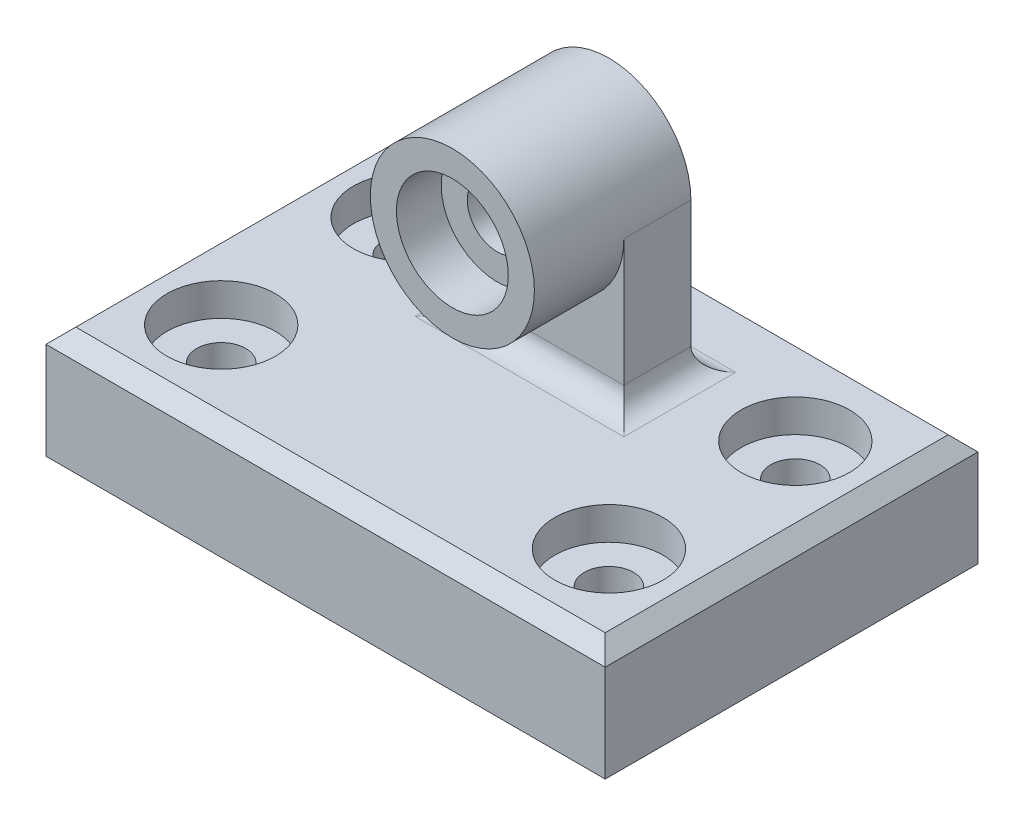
ISO-10303-21;
HEADER;
FILE_DESCRIPTION(('STEP AP214'),'2;1');
FILE_NAME('part.step','',(''),(''),'','','');
FILE_SCHEMA(('AUTOMOTIVE_DESIGN { 1 0 10303 214 1 1 1 1 }'));
ENDSEC;
DATA;
#1=APPLICATION_CONTEXT('core data for automotive mechanical design processes');
#2=APPLICATION_PROTOCOL_DEFINITION('international standard','automotive_design',2000,#1);
#3=PRODUCT_CONTEXT('',#1,'mechanical');
#4=PRODUCT('Part','Part','',(#3));
#5=PRODUCT_RELATED_PRODUCT_CATEGORY('part','',(#4));
#6=PRODUCT_DEFINITION_FORMATION('','',#4);
#7=PRODUCT_DEFINITION_CONTEXT('part definition',#1,'design');
#8=PRODUCT_DEFINITION('design','',#6,#7);
#9=PRODUCT_DEFINITION_SHAPE('','',#8);
#10=(LENGTH_UNIT() NAMED_UNIT(*) SI_UNIT(.MILLI.,.METRE.));
#11=(NAMED_UNIT(*) PLANE_ANGLE_UNIT() SI_UNIT($,.RADIAN.));
#12=(NAMED_UNIT(*) SI_UNIT($,.STERADIAN.) SOLID_ANGLE_UNIT());
#13=UNCERTAINTY_MEASURE_WITH_UNIT(LENGTH_MEASURE(1.E-05),#10,'distance_accuracy_value','');
#14=(GEOMETRIC_REPRESENTATION_CONTEXT(3) GLOBAL_UNCERTAINTY_ASSIGNED_CONTEXT((#13)) GLOBAL_UNIT_ASSIGNED_CONTEXT((#10,
#11,#12)) REPRESENTATION_CONTEXT('',''));
#15=CARTESIAN_POINT('',(0.,0.,0.));
#16=DIRECTION('',(0.,0.,1.));
#17=DIRECTION('',(1.,0.,0.));
#18=AXIS2_PLACEMENT_3D('',#15,#16,#17);
#19=CARTESIAN_POINT('',(0.,35.,-25.001));
#20=DIRECTION('',(0.,0.,1.));
#21=DIRECTION('',(1.,0.,0.));
#22=AXIS2_PLACEMENT_3D('',#19,#20,#21);
#23=CYLINDRICAL_SURFACE('',#22,4.00000000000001);
#24=CARTESIAN_POINT('',(0.,35.,-13.));
#25=DIRECTION('',(0.,0.,1.));
#26=DIRECTION('',(1.,0.,0.));
#27=AXIS2_PLACEMENT_3D('',#24,#25,#26);
#28=CIRCLE('',#27,4.00000000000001);
#29=CARTESIAN_POINT('',(4.00000000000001,35.,-13.));
#30=VERTEX_POINT('',#29);
#31=EDGE_CURVE('E150',#30,#30,#28,.F.);
#32=ORIENTED_EDGE('',*,*,#31,.T.);
#33=EDGE_LOOP('',(#32));
#34=FACE_BOUND('',#33,.T.);
#35=CARTESIAN_POINT('',(0.,35.,2.));
#36=DIRECTION('',(0.,0.,1.));
#37=DIRECTION('',(1.,0.,0.));
#38=AXIS2_PLACEMENT_3D('',#35,#36,#37);
#39=CIRCLE('',#38,4.00000000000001);
#40=CARTESIAN_POINT('',(4.00000000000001,35.,2.));
#41=VERTEX_POINT('',#40);
#42=EDGE_CURVE('E155',#41,#41,#39,.F.);
#43=ORIENTED_EDGE('',*,*,#42,.F.);
#44=EDGE_LOOP('',(#43));
#45=FACE_BOUND('',#44,.T.);
#46=ADVANCED_FACE('F35',(#34,#45),#23,.F.);
#47=CARTESIAN_POINT('',(0.,15.,0.));
#48=DIRECTION('',(0.,1.,0.));
#49=DIRECTION('',(0.,0.,1.));
#50=AXIS2_PLACEMENT_3D('',#47,#48,#49);
#51=PLANE('',#50);
#52=CARTESIAN_POINT('',(26.,15.,-12.));
#53=DIRECTION('',(0.,1.,0.));
#54=DIRECTION('',(0.,0.,1.));
#55=AXIS2_PLACEMENT_3D('',#52,#53,#54);
#56=CIRCLE('',#55,7.275);
#57=CARTESIAN_POINT('',(26.,15.,-4.72500000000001));
#58=VERTEX_POINT('',#57);
#59=EDGE_CURVE('E678',#58,#58,#56,.T.);
#60=ORIENTED_EDGE('',*,*,#59,.F.);
#61=EDGE_LOOP('',(#60));
#62=FACE_BOUND('',#61,.T.);
#63=CARTESIAN_POINT('',(26.,15.,13.));
#64=DIRECTION('',(0.,1.,0.));
#65=DIRECTION('',(0.,0.,1.));
#66=AXIS2_PLACEMENT_3D('',#63,#64,#65);
#67=CIRCLE('',#66,7.275);
#68=CARTESIAN_POINT('',(26.,15.,20.275));
#69=VERTEX_POINT('',#68);
#70=EDGE_CURVE('E666',#69,#69,#67,.T.);
#71=ORIENTED_EDGE('',*,*,#70,.F.);
#72=EDGE_LOOP('',(#71));
#73=FACE_BOUND('',#72,.T.);
#74=CARTESIAN_POINT('',(-26.,15.,-12.));
#75=DIRECTION('',(0.,1.,0.));
#76=DIRECTION('',(0.,0.,1.));
#77=AXIS2_PLACEMENT_3D('',#74,#75,#76);
#78=CIRCLE('',#77,7.275);
#79=CARTESIAN_POINT('',(-26.,15.,-4.72500000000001));
#80=VERTEX_POINT('',#79);
#81=EDGE_CURVE('E654',#80,#80,#78,.T.);
#82=ORIENTED_EDGE('',*,*,#81,.F.);
#83=EDGE_LOOP('',(#82));
#84=FACE_BOUND('',#83,.T.);
#85=DIRECTION('',(-1.,0.,0.));
#86=VECTOR('',#85,1.);
#87=CARTESIAN_POINT('',(0.,15.,-1.00000000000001));
#88=LINE('',#87,#86);
#89=CARTESIAN_POINT('',(14.,15.,-1.00000000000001));
#90=VERTEX_POINT('',#89);
#91=CARTESIAN_POINT('',(-14.,15.,-1.00000000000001));
#92=VERTEX_POINT('',#91);
#93=EDGE_CURVE('E205',#90,#92,#88,.T.);
#94=ORIENTED_EDGE('',*,*,#93,.T.);
#95=DIRECTION('',(0.,0.,-1.));
#96=VECTOR('',#95,1.);
#97=CARTESIAN_POINT('',(-14.,15.,0.));
#98=LINE('',#97,#96);
#99=CARTESIAN_POINT('',(-14.,15.,-16.));
#100=VERTEX_POINT('',#99);
#101=EDGE_CURVE('E222',#92,#100,#98,.T.);
#102=ORIENTED_EDGE('',*,*,#101,.T.);
#103=DIRECTION('',(1.,0.,0.));
#104=VECTOR('',#103,1.);
#105=CARTESIAN_POINT('',(0.,15.,-16.));
#106=LINE('',#105,#104);
#107=CARTESIAN_POINT('',(14.,15.,-16.));
#108=VERTEX_POINT('',#107);
#109=EDGE_CURVE('E220',#100,#108,#106,.T.);
#110=ORIENTED_EDGE('',*,*,#109,.T.);
#111=DIRECTION('',(0.,0.,1.));
#112=VECTOR('',#111,1.);
#113=CARTESIAN_POINT('',(14.,15.,0.));
#114=LINE('',#113,#112);
#115=EDGE_CURVE('E218',#108,#90,#114,.T.);
#116=ORIENTED_EDGE('',*,*,#115,.T.);
#117=EDGE_LOOP('',(#94,#102,#110,#116));
#118=FACE_BOUND('',#117,.T.);
#119=DIRECTION('',(1.,0.,0.));
#120=VECTOR('',#119,1.);
#121=CARTESIAN_POINT('',(37.5,15.,23.));
#122=LINE('',#121,#120);
#123=CARTESIAN_POINT('',(-35.5,15.,23.));
#124=VERTEX_POINT('',#123);
#125=CARTESIAN_POINT('',(35.5,15.,23.));
#126=VERTEX_POINT('',#125);
#127=EDGE_CURVE('E191',#124,#126,#122,.T.);
#128=ORIENTED_EDGE('',*,*,#127,.T.);
#129=DIRECTION('',(0.,0.,-1.));
#130=VECTOR('',#129,1.);
#131=CARTESIAN_POINT('',(35.5,15.,-25.));
#132=LINE('',#131,#130);
#133=CARTESIAN_POINT('',(35.5,15.,-23.));
#134=VERTEX_POINT('',#133);
#135=EDGE_CURVE('E193',#126,#134,#132,.T.);
#136=ORIENTED_EDGE('',*,*,#135,.T.);
#137=DIRECTION('',(-1.,0.,0.));
#138=VECTOR('',#137,1.);
#139=CARTESIAN_POINT('',(-37.5,15.,-23.));
#140=LINE('',#139,#138);
#141=CARTESIAN_POINT('',(-35.5,15.,-23.));
#142=VERTEX_POINT('',#141);
#143=EDGE_CURVE('E189',#134,#142,#140,.T.);
#144=ORIENTED_EDGE('',*,*,#143,.T.);
#145=DIRECTION('',(0.,0.,1.));
#146=VECTOR('',#145,1.);
#147=CARTESIAN_POINT('',(-35.5,15.,25.));
#148=LINE('',#147,#146);
#149=EDGE_CURVE('E184',#142,#124,#148,.T.);
#150=ORIENTED_EDGE('',*,*,#149,.T.);
#151=EDGE_LOOP('',(#128,#136,#144,#150));
#152=FACE_BOUND('',#151,.T.);
#153=CARTESIAN_POINT('',(-26.,15.,13.));
#154=DIRECTION('',(0.,1.,0.));
#155=DIRECTION('',(0.,0.,1.));
#156=AXIS2_PLACEMENT_3D('',#153,#154,#155);
#157=CIRCLE('',#156,7.275);
#158=CARTESIAN_POINT('',(-26.,15.,20.275));
#159=VERTEX_POINT('',#158);
#160=EDGE_CURVE('E216',#159,#159,#157,.T.);
#161=ORIENTED_EDGE('',*,*,#160,.F.);
#162=EDGE_LOOP('',(#161));
#163=FACE_BOUND('',#162,.T.);
#164=ADVANCED_FACE('F263',(#62,#73,#84,#118,#152,#163),#51,.T.);
#165=CARTESIAN_POINT('',(37.5,15.,-25.));
#166=DIRECTION('',(-1.,0.,0.));
#167=DIRECTION('',(0.,0.,1.));
#168=AXIS2_PLACEMENT_3D('',#165,#166,#167);
#169=PLANE('',#168);
#170=DIRECTION('',(0.,-1.,0.));
#171=VECTOR('',#170,1.);
#172=CARTESIAN_POINT('',(37.5,15.,-25.));
#173=LINE('',#172,#171);
#174=CARTESIAN_POINT('',(37.5,13.,-25.));
#175=VERTEX_POINT('',#174);
#176=CARTESIAN_POINT('',(37.5,0.,-25.));
#177=VERTEX_POINT('',#176);
#178=EDGE_CURVE('E182',#175,#177,#173,.T.);
#179=ORIENTED_EDGE('',*,*,#178,.F.);
#180=DIRECTION('',(0.,0.,1.));
#181=VECTOR('',#180,1.);
#182=CARTESIAN_POINT('',(37.5,13.,25.));
#183=LINE('',#182,#181);
#184=CARTESIAN_POINT('',(37.5,13.,25.));
#185=VERTEX_POINT('',#184);
#186=EDGE_CURVE('E196',#175,#185,#183,.T.);
#187=ORIENTED_EDGE('',*,*,#186,.T.);
#188=DIRECTION('',(0.,-1.,0.));
#189=VECTOR('',#188,1.);
#190=CARTESIAN_POINT('',(37.5,15.,25.));
#191=LINE('',#190,#189);
#192=CARTESIAN_POINT('',(37.5,0.,25.));
#193=VERTEX_POINT('',#192);
#194=EDGE_CURVE('E176',#185,#193,#191,.T.);
#195=ORIENTED_EDGE('',*,*,#194,.T.);
#196=DIRECTION('',(0.,0.,-1.));
#197=VECTOR('',#196,1.);
#198=CARTESIAN_POINT('',(37.5,0.,-25.));
#199=LINE('',#198,#197);
#200=EDGE_CURVE('E164',#193,#177,#199,.T.);
#201=ORIENTED_EDGE('',*,*,#200,.T.);
#202=EDGE_LOOP('',(#179,#187,#195,#201));
#203=FACE_BOUND('',#202,.T.);
#204=ADVANCED_FACE('F269',(#203),#169,.F.);
#205=CARTESIAN_POINT('',(-37.5,15.,-25.));
#206=DIRECTION('',(0.,0.,1.));
#207=DIRECTION('',(1.,0.,0.));
#208=AXIS2_PLACEMENT_3D('',#205,#206,#207);
#209=PLANE('',#208);
#210=DIRECTION('',(0.,-1.,0.));
#211=VECTOR('',#210,1.);
#212=CARTESIAN_POINT('',(-37.5,15.,-25.));
#213=LINE('',#212,#211);
#214=CARTESIAN_POINT('',(-37.5,13.,-25.));
#215=VERTEX_POINT('',#214);
#216=CARTESIAN_POINT('',(-37.5,0.,-25.));
#217=VERTEX_POINT('',#216);
#218=EDGE_CURVE('E180',#215,#217,#213,.T.);
#219=ORIENTED_EDGE('',*,*,#218,.F.);
#220=DIRECTION('',(1.,0.,0.));
#221=VECTOR('',#220,1.);
#222=CARTESIAN_POINT('',(37.5,13.,-25.));
#223=LINE('',#222,#221);
#224=EDGE_CURVE('E201',#215,#175,#223,.T.);
#225=ORIENTED_EDGE('',*,*,#224,.T.);
#226=ORIENTED_EDGE('',*,*,#178,.T.);
#227=DIRECTION('',(-1.,0.,0.));
#228=VECTOR('',#227,1.);
#229=CARTESIAN_POINT('',(-37.5,0.,-25.));
#230=LINE('',#229,#228);
#231=EDGE_CURVE('E167',#177,#217,#230,.T.);
#232=ORIENTED_EDGE('',*,*,#231,.T.);
#233=EDGE_LOOP('',(#219,#225,#226,#232));
#234=FACE_BOUND('',#233,.T.);
#235=ADVANCED_FACE('F562',(#234),#209,.F.);
#236=CARTESIAN_POINT('',(-37.5,15.,-25.));
#237=DIRECTION('',(1.,0.,0.));
#238=DIRECTION('',(0.,0.,-1.));
#239=AXIS2_PLACEMENT_3D('',#236,#237,#238);
#240=PLANE('',#239);
#241=DIRECTION('',(0.,-1.,0.));
#242=VECTOR('',#241,1.);
#243=CARTESIAN_POINT('',(-37.5,15.,25.));
#244=LINE('',#243,#242);
#245=CARTESIAN_POINT('',(-37.5,13.,25.));
#246=VERTEX_POINT('',#245);
#247=CARTESIAN_POINT('',(-37.5,0.,25.));
#248=VERTEX_POINT('',#247);
#249=EDGE_CURVE('E178',#246,#248,#244,.T.);
#250=ORIENTED_EDGE('',*,*,#249,.F.);
#251=DIRECTION('',(0.,0.,-1.));
#252=VECTOR('',#251,1.);
#253=CARTESIAN_POINT('',(-37.5,13.,-25.));
#254=LINE('',#253,#252);
#255=EDGE_CURVE('E203',#246,#215,#254,.T.);
#256=ORIENTED_EDGE('',*,*,#255,.T.);
#257=ORIENTED_EDGE('',*,*,#218,.T.);
#258=DIRECTION('',(0.,0.,1.));
#259=VECTOR('',#258,1.);
#260=CARTESIAN_POINT('',(-37.5,0.,-25.));
#261=LINE('',#260,#259);
#262=EDGE_CURVE('E170',#217,#248,#261,.T.);
#263=ORIENTED_EDGE('',*,*,#262,.T.);
#264=EDGE_LOOP('',(#250,#256,#257,#263));
#265=FACE_BOUND('',#264,.T.);
#266=ADVANCED_FACE('F554',(#265),#240,.F.);
#267=CARTESIAN_POINT('',(-37.5,15.,25.));
#268=DIRECTION('',(0.,0.,-1.));
#269=DIRECTION('',(-1.,0.,0.));
#270=AXIS2_PLACEMENT_3D('',#267,#268,#269);
#271=PLANE('',#270);
#272=ORIENTED_EDGE('',*,*,#194,.F.);
#273=DIRECTION('',(-1.,0.,0.));
#274=VECTOR('',#273,1.);
#275=CARTESIAN_POINT('',(-37.5,13.,25.));
#276=LINE('',#275,#274);
#277=EDGE_CURVE('E199',#185,#246,#276,.T.);
#278=ORIENTED_EDGE('',*,*,#277,.T.);
#279=ORIENTED_EDGE('',*,*,#249,.T.);
#280=DIRECTION('',(1.,0.,0.));
#281=VECTOR('',#280,1.);
#282=CARTESIAN_POINT('',(-37.5,0.,25.));
#283=LINE('',#282,#281);
#284=EDGE_CURVE('E173',#248,#193,#283,.T.);
#285=ORIENTED_EDGE('',*,*,#284,.T.);
#286=EDGE_LOOP('',(#272,#278,#279,#285));
#287=FACE_BOUND('',#286,.T.);
#288=ADVANCED_FACE('F547',(#287),#271,.F.);
#289=CARTESIAN_POINT('',(0.,0.,0.));
#290=DIRECTION('',(0.,1.,0.));
#291=DIRECTION('',(0.,0.,1.));
#292=AXIS2_PLACEMENT_3D('',#289,#290,#291);
#293=PLANE('',#292);
#294=CARTESIAN_POINT('',(26.,0.,-12.));
#295=DIRECTION('',(0.,1.,0.));
#296=DIRECTION('',(0.,0.,1.));
#297=AXIS2_PLACEMENT_3D('',#294,#295,#296);
#298=CIRCLE('',#297,3.3);
#299=CARTESIAN_POINT('',(26.,0.,-8.70000000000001));
#300=VERTEX_POINT('',#299);
#301=EDGE_CURVE('E669',#300,#300,#298,.T.);
#302=ORIENTED_EDGE('',*,*,#301,.T.);
#303=EDGE_LOOP('',(#302));
#304=FACE_BOUND('',#303,.T.);
#305=CARTESIAN_POINT('',(26.,0.,13.));
#306=DIRECTION('',(0.,1.,0.));
#307=DIRECTION('',(0.,0.,1.));
#308=AXIS2_PLACEMENT_3D('',#305,#306,#307);
#309=CIRCLE('',#308,3.3);
#310=CARTESIAN_POINT('',(26.,0.,16.3));
#311=VERTEX_POINT('',#310);
#312=EDGE_CURVE('E657',#311,#311,#309,.T.);
#313=ORIENTED_EDGE('',*,*,#312,.T.);
#314=EDGE_LOOP('',(#313));
#315=FACE_BOUND('',#314,.T.);
#316=CARTESIAN_POINT('',(-26.,0.,-12.));
#317=DIRECTION('',(0.,1.,0.));
#318=DIRECTION('',(0.,0.,1.));
#319=AXIS2_PLACEMENT_3D('',#316,#317,#318);
#320=CIRCLE('',#319,3.3);
#321=CARTESIAN_POINT('',(-26.,0.,-8.70000000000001));
#322=VERTEX_POINT('',#321);
#323=EDGE_CURVE('E232',#322,#322,#320,.T.);
#324=ORIENTED_EDGE('',*,*,#323,.T.);
#325=EDGE_LOOP('',(#324));
#326=FACE_BOUND('',#325,.T.);
#327=CARTESIAN_POINT('',(-26.,0.,13.));
#328=DIRECTION('',(0.,1.,0.));
#329=DIRECTION('',(0.,0.,1.));
#330=AXIS2_PLACEMENT_3D('',#327,#328,#329);
#331=CIRCLE('',#330,3.3);
#332=CARTESIAN_POINT('',(-26.,0.,16.3));
#333=VERTEX_POINT('',#332);
#334=EDGE_CURVE('E629',#333,#333,#331,.T.);
#335=ORIENTED_EDGE('',*,*,#334,.T.);
#336=EDGE_LOOP('',(#335));
#337=FACE_BOUND('',#336,.T.);
#338=ORIENTED_EDGE('',*,*,#200,.F.);
#339=ORIENTED_EDGE('',*,*,#284,.F.);
#340=ORIENTED_EDGE('',*,*,#262,.F.);
#341=ORIENTED_EDGE('',*,*,#231,.F.);
#342=EDGE_LOOP('',(#338,#339,#340,#341));
#343=FACE_BOUND('',#342,.T.);
#344=ADVANCED_FACE('F538',(#304,#315,#326,#337,#343),#293,.F.);
#345=CARTESIAN_POINT('',(-11.,35.,-4.00000000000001));
#346=DIRECTION('',(1.,0.,0.));
#347=DIRECTION('',(0.,0.,-1.));
#348=AXIS2_PLACEMENT_3D('',#345,#346,#347);
#349=PLANE('',#348);
#350=DIRECTION('',(0.,-1.,0.));
#351=VECTOR('',#350,1.);
#352=CARTESIAN_POINT('',(-11.,35.,-13.));
#353=LINE('',#352,#351);
#354=CARTESIAN_POINT('',(-11.,35.,-13.));
#355=VERTEX_POINT('',#354);
#356=CARTESIAN_POINT('',(-11.,18.,-13.));
#357=VERTEX_POINT('',#356);
#358=EDGE_CURVE('E129',#355,#357,#353,.T.);
#359=ORIENTED_EDGE('',*,*,#358,.T.);
#360=DIRECTION('',(0.,0.,-1.));
#361=VECTOR('',#360,1.);
#362=CARTESIAN_POINT('',(-11.,18.,-4.00000000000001));
#363=LINE('',#362,#361);
#364=CARTESIAN_POINT('',(-11.,18.,-4.00000000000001));
#365=VERTEX_POINT('',#364);
#366=EDGE_CURVE('E225',#357,#365,#363,.F.);
#367=ORIENTED_EDGE('',*,*,#366,.T.);
#368=DIRECTION('',(0.,-1.,0.));
#369=VECTOR('',#368,1.);
#370=CARTESIAN_POINT('',(-11.,35.,-4.00000000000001));
#371=LINE('',#370,#369);
#372=CARTESIAN_POINT('',(-11.,35.,-4.00000000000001));
#373=VERTEX_POINT('',#372);
#374=EDGE_CURVE('E131',#373,#365,#371,.T.);
#375=ORIENTED_EDGE('',*,*,#374,.F.);
#376=DIRECTION('',(0.,0.,1.));
#377=VECTOR('',#376,1.);
#378=CARTESIAN_POINT('',(-11.,35.,-4.00000000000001));
#379=LINE('',#378,#377);
#380=EDGE_CURVE('E125',#355,#373,#379,.T.);
#381=ORIENTED_EDGE('',*,*,#380,.F.);
#382=EDGE_LOOP('',(#359,#367,#375,#381));
#383=FACE_BOUND('',#382,.T.);
#384=ADVANCED_FACE('F127',(#383),#349,.F.);
#385=CARTESIAN_POINT('',(-11.,35.,-4.00000000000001));
#386=DIRECTION('',(0.,0.,-1.));
#387=DIRECTION('',(-1.,0.,0.));
#388=AXIS2_PLACEMENT_3D('',#385,#386,#387);
#389=PLANE('',#388);
#390=ORIENTED_EDGE('',*,*,#374,.T.);
#391=DIRECTION('',(-1.,0.,0.));
#392=VECTOR('',#391,1.);
#393=CARTESIAN_POINT('',(-11.,18.,-4.00000000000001));
#394=LINE('',#393,#392);
#395=CARTESIAN_POINT('',(11.,18.,-4.00000000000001));
#396=VERTEX_POINT('',#395);
#397=EDGE_CURVE('E11',#365,#396,#394,.F.);
#398=ORIENTED_EDGE('',*,*,#397,.T.);
#399=DIRECTION('',(0.,-1.,0.));
#400=VECTOR('',#399,1.);
#401=CARTESIAN_POINT('',(11.,35.,-4.00000000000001));
#402=LINE('',#401,#400);
#403=CARTESIAN_POINT('',(11.,35.,-4.00000000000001));
#404=VERTEX_POINT('',#403);
#405=EDGE_CURVE('E161',#404,#396,#402,.T.);
#406=ORIENTED_EDGE('',*,*,#405,.F.);
#407=CARTESIAN_POINT('',(0.,35.,-4.00000000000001));
#408=DIRECTION('',(0.,0.,-1.));
#409=DIRECTION('',(-1.,0.,0.));
#410=AXIS2_PLACEMENT_3D('',#407,#408,#409);
#411=CIRCLE('',#410,11.);
#412=EDGE_CURVE('E136',#404,#373,#411,.T.);
#413=ORIENTED_EDGE('',*,*,#412,.T.);
#414=EDGE_LOOP('',(#390,#398,#406,#413));
#415=FACE_BOUND('',#414,.T.);
#416=ADVANCED_FACE('F251',(#415),#389,.F.);
#417=CARTESIAN_POINT('',(11.,35.,-4.00000000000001));
#418=DIRECTION('',(-1.,0.,0.));
#419=DIRECTION('',(0.,0.,1.));
#420=AXIS2_PLACEMENT_3D('',#417,#418,#419);
#421=PLANE('',#420);
#422=ORIENTED_EDGE('',*,*,#405,.T.);
#423=DIRECTION('',(0.,0.,1.));
#424=VECTOR('',#423,1.);
#425=CARTESIAN_POINT('',(11.,18.,-4.00000000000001));
#426=LINE('',#425,#424);
#427=CARTESIAN_POINT('',(11.,18.,-13.));
#428=VERTEX_POINT('',#427);
#429=EDGE_CURVE('E44',#396,#428,#426,.F.);
#430=ORIENTED_EDGE('',*,*,#429,.T.);
#431=DIRECTION('',(0.,-1.,0.));
#432=VECTOR('',#431,1.);
#433=CARTESIAN_POINT('',(11.,35.,-13.));
#434=LINE('',#433,#432);
#435=CARTESIAN_POINT('',(11.,35.,-13.));
#436=VERTEX_POINT('',#435);
#437=EDGE_CURVE('E144',#436,#428,#434,.T.);
#438=ORIENTED_EDGE('',*,*,#437,.F.);
#439=DIRECTION('',(0.,0.,-1.));
#440=VECTOR('',#439,1.);
#441=CARTESIAN_POINT('',(11.,35.,-4.00000000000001));
#442=LINE('',#441,#440);
#443=EDGE_CURVE('E135',#404,#436,#442,.T.);
#444=ORIENTED_EDGE('',*,*,#443,.F.);
#445=EDGE_LOOP('',(#422,#430,#438,#444));
#446=FACE_BOUND('',#445,.T.);
#447=ADVANCED_FACE('F252',(#446),#421,.F.);
#448=CARTESIAN_POINT('',(-11.,35.,-13.));
#449=DIRECTION('',(0.,0.,1.));
#450=DIRECTION('',(1.,0.,0.));
#451=AXIS2_PLACEMENT_3D('',#448,#449,#450);
#452=PLANE('',#451);
#453=ORIENTED_EDGE('',*,*,#31,.F.);
#454=EDGE_LOOP('',(#453));
#455=FACE_BOUND('',#454,.T.);
#456=ORIENTED_EDGE('',*,*,#437,.T.);
#457=DIRECTION('',(1.,0.,0.));
#458=VECTOR('',#457,1.);
#459=CARTESIAN_POINT('',(-11.,18.,-13.));
#460=LINE('',#459,#458);
#461=EDGE_CURVE('E143',#428,#357,#460,.F.);
#462=ORIENTED_EDGE('',*,*,#461,.T.);
#463=ORIENTED_EDGE('',*,*,#358,.F.);
#464=CARTESIAN_POINT('',(0.,35.,-13.));
#465=DIRECTION('',(0.,0.,-1.));
#466=DIRECTION('',(-1.,0.,0.));
#467=AXIS2_PLACEMENT_3D('',#464,#465,#466);
#468=CIRCLE('',#467,11.);
#469=EDGE_CURVE('E141',#355,#436,#468,.T.);
#470=ORIENTED_EDGE('',*,*,#469,.T.);
#471=EDGE_LOOP('',(#456,#462,#463,#470));
#472=FACE_BOUND('',#471,.T.);
#473=ADVANCED_FACE('F140',(#455,#472),#452,.F.);
#474=CARTESIAN_POINT('',(0.,35.,8.));
#475=DIRECTION('',(0.,0.,-1.));
#476=DIRECTION('',(-1.,0.,0.));
#477=AXIS2_PLACEMENT_3D('',#474,#475,#476);
#478=CYLINDRICAL_SURFACE('',#477,11.);
#479=CARTESIAN_POINT('',(0.,35.,8.));
#480=DIRECTION('',(0.,0.,-1.));
#481=DIRECTION('',(-1.,0.,0.));
#482=AXIS2_PLACEMENT_3D('',#479,#480,#481);
#483=CIRCLE('',#482,11.);
#484=CARTESIAN_POINT('',(-11.,35.,8.));
#485=VERTEX_POINT('',#484);
#486=EDGE_CURVE('E149',#485,#485,#483,.T.);
#487=ORIENTED_EDGE('',*,*,#486,.T.);
#488=EDGE_LOOP('',(#487));
#489=FACE_BOUND('',#488,.T.);
#490=ORIENTED_EDGE('',*,*,#380,.T.);
#491=ORIENTED_EDGE('',*,*,#412,.F.);
#492=ORIENTED_EDGE('',*,*,#443,.T.);
#493=ORIENTED_EDGE('',*,*,#469,.F.);
#494=EDGE_LOOP('',(#490,#491,#492,#493));
#495=FACE_BOUND('',#494,.T.);
#496=ADVANCED_FACE('F147',(#489,#495),#478,.T.);
#497=CARTESIAN_POINT('',(0.,35.,8.));
#498=DIRECTION('',(0.,0.,-1.));
#499=DIRECTION('',(-1.,0.,0.));
#500=AXIS2_PLACEMENT_3D('',#497,#498,#499);
#501=PLANE('',#500);
#502=CARTESIAN_POINT('',(0.,35.,8.));
#503=DIRECTION('',(0.,0.,1.));
#504=DIRECTION('',(1.,0.,0.));
#505=AXIS2_PLACEMENT_3D('',#502,#503,#504);
#506=CIRCLE('',#505,7.5);
#507=CARTESIAN_POINT('',(7.5,35.,8.));
#508=VERTEX_POINT('',#507);
#509=EDGE_CURVE('E632',#508,#508,#506,.T.);
#510=ORIENTED_EDGE('',*,*,#509,.F.);
#511=EDGE_LOOP('',(#510));
#512=FACE_BOUND('',#511,.T.);
#513=ORIENTED_EDGE('',*,*,#486,.F.);
#514=EDGE_LOOP('',(#513));
#515=FACE_BOUND('',#514,.T.);
#516=ADVANCED_FACE('F277',(#512,#515),#501,.F.);
#517=CARTESIAN_POINT('',(0.,35.,2.));
#518=DIRECTION('',(0.,0.,1.));
#519=DIRECTION('',(1.,0.,0.));
#520=AXIS2_PLACEMENT_3D('',#517,#518,#519);
#521=PLANE('',#520);
#522=CARTESIAN_POINT('',(0.,35.,2.));
#523=DIRECTION('',(0.,0.,1.));
#524=DIRECTION('',(1.,0.,0.));
#525=AXIS2_PLACEMENT_3D('',#522,#523,#524);
#526=CIRCLE('',#525,7.5);
#527=CARTESIAN_POINT('',(7.5,35.,2.));
#528=VERTEX_POINT('',#527);
#529=EDGE_CURVE('E187',#528,#528,#526,.T.);
#530=ORIENTED_EDGE('',*,*,#529,.T.);
#531=EDGE_LOOP('',(#530));
#532=FACE_BOUND('',#531,.T.);
#533=ORIENTED_EDGE('',*,*,#42,.T.);
#534=EDGE_LOOP('',(#533));
#535=FACE_BOUND('',#534,.T.);
#536=ADVANCED_FACE('F280',(#532,#535),#521,.T.);
#537=CARTESIAN_POINT('',(0.,35.,2.));
#538=DIRECTION('',(0.,0.,1.));
#539=DIRECTION('',(1.,0.,0.));
#540=AXIS2_PLACEMENT_3D('',#537,#538,#539);
#541=CYLINDRICAL_SURFACE('',#540,7.5);
#542=ORIENTED_EDGE('',*,*,#529,.F.);
#543=EDGE_LOOP('',(#542));
#544=FACE_BOUND('',#543,.T.);
#545=ORIENTED_EDGE('',*,*,#509,.T.);
#546=EDGE_LOOP('',(#545));
#547=FACE_BOUND('',#546,.T.);
#548=ADVANCED_FACE('F275',(#544,#547),#541,.F.);
#549=CARTESIAN_POINT('',(-26.,15.,13.));
#550=DIRECTION('',(0.,1.,0.));
#551=DIRECTION('',(0.,0.,1.));
#552=AXIS2_PLACEMENT_3D('',#549,#550,#551);
#553=CYLINDRICAL_SURFACE('',#552,3.3);
#554=ORIENTED_EDGE('',*,*,#334,.F.);
#555=EDGE_LOOP('',(#554));
#556=FACE_BOUND('',#555,.T.);
#557=CARTESIAN_POINT('',(-26.,10.62,13.));
#558=DIRECTION('',(0.,1.,0.));
#559=DIRECTION('',(0.,0.,1.));
#560=AXIS2_PLACEMENT_3D('',#557,#558,#559);
#561=CIRCLE('',#560,3.3);
#562=CARTESIAN_POINT('',(-26.,10.62,16.3));
#563=VERTEX_POINT('',#562);
#564=EDGE_CURVE('E622',#563,#563,#561,.T.);
#565=ORIENTED_EDGE('',*,*,#564,.T.);
#566=EDGE_LOOP('',(#565));
#567=FACE_BOUND('',#566,.T.);
#568=ADVANCED_FACE('F306',(#556,#567),#553,.F.);
#569=CARTESIAN_POINT('',(-22.7,10.62,13.));
#570=DIRECTION('',(0.,-1.,0.));
#571=DIRECTION('',(0.,0.,-1.));
#572=AXIS2_PLACEMENT_3D('',#569,#570,#571);
#573=PLANE('',#572);
#574=ORIENTED_EDGE('',*,*,#564,.F.);
#575=EDGE_LOOP('',(#574));
#576=FACE_BOUND('',#575,.T.);
#577=CARTESIAN_POINT('',(-26.,10.62,13.));
#578=DIRECTION('',(0.,1.,0.));
#579=DIRECTION('',(0.,0.,1.));
#580=AXIS2_PLACEMENT_3D('',#577,#578,#579);
#581=CIRCLE('',#580,7.275);
#582=CARTESIAN_POINT('',(-26.,10.62,20.275));
#583=VERTEX_POINT('',#582);
#584=EDGE_CURVE('E619',#583,#583,#581,.T.);
#585=ORIENTED_EDGE('',*,*,#584,.T.);
#586=EDGE_LOOP('',(#585));
#587=FACE_BOUND('',#586,.T.);
#588=ADVANCED_FACE('F313',(#576,#587),#573,.F.);
#589=CARTESIAN_POINT('',(-26.,15.,13.));
#590=DIRECTION('',(0.,1.,0.));
#591=DIRECTION('',(0.,0.,1.));
#592=AXIS2_PLACEMENT_3D('',#589,#590,#591);
#593=CYLINDRICAL_SURFACE('',#592,7.275);
#594=ORIENTED_EDGE('',*,*,#584,.F.);
#595=EDGE_LOOP('',(#594));
#596=FACE_BOUND('',#595,.T.);
#597=ORIENTED_EDGE('',*,*,#160,.T.);
#598=EDGE_LOOP('',(#597));
#599=FACE_BOUND('',#598,.T.);
#600=ADVANCED_FACE('F321',(#596,#599),#593,.F.);
#601=CARTESIAN_POINT('',(-35.5,15.,0.));
#602=DIRECTION('',(-0.707106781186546,0.707106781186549,0.));
#603=DIRECTION('',(0.,0.,-1.));
#604=AXIS2_PLACEMENT_3D('',#601,#602,#603);
#605=PLANE('',#604);
#606=DIRECTION('',(-0.577350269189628,-0.577350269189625,-0.577350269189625));
#607=VECTOR('',#606,1.);
#608=CARTESIAN_POINT('',(-27.8333333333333,22.6666666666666,-15.3333333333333));
#609=LINE('',#608,#607);
#610=EDGE_CURVE('E210',#215,#142,#609,.F.);
#611=ORIENTED_EDGE('',*,*,#610,.F.);
#612=ORIENTED_EDGE('',*,*,#255,.F.);
#613=DIRECTION('',(0.577350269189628,0.577350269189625,-0.577350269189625));
#614=VECTOR('',#613,1.);
#615=CARTESIAN_POINT('',(-27.8333333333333,22.6666666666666,15.3333333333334));
#616=LINE('',#615,#614);
#617=EDGE_CURVE('E213',#124,#246,#616,.F.);
#618=ORIENTED_EDGE('',*,*,#617,.F.);
#619=ORIENTED_EDGE('',*,*,#149,.F.);
#620=EDGE_LOOP('',(#611,#612,#618,#619));
#621=FACE_BOUND('',#620,.T.);
#622=ADVANCED_FACE('F329',(#621),#605,.T.);
#623=CARTESIAN_POINT('',(0.,15.,23.));
#624=DIRECTION('',(0.,0.707106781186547,0.707106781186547));
#625=DIRECTION('',(-1.,0.,0.));
#626=AXIS2_PLACEMENT_3D('',#623,#624,#625);
#627=PLANE('',#626);
#628=ORIENTED_EDGE('',*,*,#617,.T.);
#629=ORIENTED_EDGE('',*,*,#277,.F.);
#630=DIRECTION('',(-0.577350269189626,0.577350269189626,-0.577350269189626));
#631=VECTOR('',#630,1.);
#632=CARTESIAN_POINT('',(23.6666666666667,26.8333333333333,11.1666666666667));
#633=LINE('',#632,#631);
#634=EDGE_CURVE('E208',#126,#185,#633,.F.);
#635=ORIENTED_EDGE('',*,*,#634,.F.);
#636=ORIENTED_EDGE('',*,*,#127,.F.);
#637=EDGE_LOOP('',(#628,#629,#635,#636));
#638=FACE_BOUND('',#637,.T.);
#639=ADVANCED_FACE('F338',(#638),#627,.T.);
#640=CARTESIAN_POINT('',(0.,15.,-23.));
#641=DIRECTION('',(0.,0.707106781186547,-0.707106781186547));
#642=DIRECTION('',(1.,0.,0.));
#643=AXIS2_PLACEMENT_3D('',#640,#641,#642);
#644=PLANE('',#643);
#645=ORIENTED_EDGE('',*,*,#610,.T.);
#646=ORIENTED_EDGE('',*,*,#143,.F.);
#647=DIRECTION('',(0.577350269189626,-0.577350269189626,-0.577350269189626));
#648=VECTOR('',#647,1.);
#649=CARTESIAN_POINT('',(23.6666666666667,26.8333333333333,-11.1666666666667));
#650=LINE('',#649,#648);
#651=EDGE_CURVE('E206',#175,#134,#650,.F.);
#652=ORIENTED_EDGE('',*,*,#651,.F.);
#653=ORIENTED_EDGE('',*,*,#224,.F.);
#654=EDGE_LOOP('',(#645,#646,#652,#653));
#655=FACE_BOUND('',#654,.T.);
#656=ADVANCED_FACE('F347',(#655),#644,.T.);
#657=CARTESIAN_POINT('',(35.5,15.,0.));
#658=DIRECTION('',(0.707106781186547,0.707106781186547,0.));
#659=DIRECTION('',(0.,0.,1.));
#660=AXIS2_PLACEMENT_3D('',#657,#658,#659);
#661=PLANE('',#660);
#662=ORIENTED_EDGE('',*,*,#634,.T.);
#663=ORIENTED_EDGE('',*,*,#186,.F.);
#664=ORIENTED_EDGE('',*,*,#651,.T.);
#665=ORIENTED_EDGE('',*,*,#135,.F.);
#666=EDGE_LOOP('',(#662,#663,#664,#665));
#667=FACE_BOUND('',#666,.T.);
#668=ADVANCED_FACE('F355',(#667),#661,.T.);
#669=CARTESIAN_POINT('',(14.,18.,0.));
#670=DIRECTION('',(0.,0.,1.));
#671=DIRECTION('',(1.,0.,0.));
#672=AXIS2_PLACEMENT_3D('',#669,#670,#671);
#673=CYLINDRICAL_SURFACE('',#672,3.);
#674=CARTESIAN_POINT('',(14.,18.,-16.));
#675=DIRECTION('',(0.707106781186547,0.,0.707106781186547));
#676=DIRECTION('',(-0.707106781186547,0.,0.707106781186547));
#677=AXIS2_PLACEMENT_3D('',#674,#675,#676);
#678=ELLIPSE('',#677,4.24264068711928,3.);
#679=EDGE_CURVE('E233',#428,#108,#678,.T.);
#680=ORIENTED_EDGE('',*,*,#679,.F.);
#681=ORIENTED_EDGE('',*,*,#429,.F.);
#682=CARTESIAN_POINT('',(14.,18.,-1.00000000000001));
#683=DIRECTION('',(-0.707106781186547,0.,0.707106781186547));
#684=DIRECTION('',(-0.707106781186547,0.,-0.707106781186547));
#685=AXIS2_PLACEMENT_3D('',#682,#683,#684);
#686=ELLIPSE('',#685,4.24264068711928,3.);
#687=EDGE_CURVE('E39',#90,#396,#686,.F.);
#688=ORIENTED_EDGE('',*,*,#687,.F.);
#689=ORIENTED_EDGE('',*,*,#115,.F.);
#690=EDGE_LOOP('',(#680,#681,#688,#689));
#691=FACE_BOUND('',#690,.T.);
#692=ADVANCED_FACE('F37',(#691),#673,.F.);
#693=CARTESIAN_POINT('',(0.,18.,-1.00000000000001));
#694=DIRECTION('',(-1.,0.,0.));
#695=DIRECTION('',(0.,0.,1.));
#696=AXIS2_PLACEMENT_3D('',#693,#694,#695);
#697=CYLINDRICAL_SURFACE('',#696,3.);
#698=ORIENTED_EDGE('',*,*,#687,.T.);
#699=ORIENTED_EDGE('',*,*,#397,.F.);
#700=CARTESIAN_POINT('',(-14.,18.,-1.00000000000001));
#701=DIRECTION('',(-0.707106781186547,0.,-0.707106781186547));
#702=DIRECTION('',(-0.707106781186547,0.,0.707106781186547));
#703=AXIS2_PLACEMENT_3D('',#700,#701,#702);
#704=ELLIPSE('',#703,4.24264068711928,3.);
#705=EDGE_CURVE('E231',#92,#365,#704,.F.);
#706=ORIENTED_EDGE('',*,*,#705,.F.);
#707=ORIENTED_EDGE('',*,*,#93,.F.);
#708=EDGE_LOOP('',(#698,#699,#706,#707));
#709=FACE_BOUND('',#708,.T.);
#710=ADVANCED_FACE('F242',(#709),#697,.F.);
#711=CARTESIAN_POINT('',(0.,18.,-16.));
#712=DIRECTION('',(1.,0.,0.));
#713=DIRECTION('',(0.,0.,-1.));
#714=AXIS2_PLACEMENT_3D('',#711,#712,#713);
#715=CYLINDRICAL_SURFACE('',#714,3.);
#716=ORIENTED_EDGE('',*,*,#679,.T.);
#717=ORIENTED_EDGE('',*,*,#109,.F.);
#718=CARTESIAN_POINT('',(-14.,18.,-16.));
#719=DIRECTION('',(0.707106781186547,0.,-0.707106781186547));
#720=DIRECTION('',(0.707106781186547,0.,0.707106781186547));
#721=AXIS2_PLACEMENT_3D('',#718,#719,#720);
#722=ELLIPSE('',#721,4.24264068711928,3.);
#723=EDGE_CURVE('E229',#357,#100,#722,.T.);
#724=ORIENTED_EDGE('',*,*,#723,.F.);
#725=ORIENTED_EDGE('',*,*,#461,.F.);
#726=EDGE_LOOP('',(#716,#717,#724,#725));
#727=FACE_BOUND('',#726,.T.);
#728=ADVANCED_FACE('F247',(#727),#715,.F.);
#729=CARTESIAN_POINT('',(-14.,18.,0.));
#730=DIRECTION('',(0.,0.,-1.));
#731=DIRECTION('',(-1.,0.,0.));
#732=AXIS2_PLACEMENT_3D('',#729,#730,#731);
#733=CYLINDRICAL_SURFACE('',#732,3.);
#734=ORIENTED_EDGE('',*,*,#705,.T.);
#735=ORIENTED_EDGE('',*,*,#366,.F.);
#736=ORIENTED_EDGE('',*,*,#723,.T.);
#737=ORIENTED_EDGE('',*,*,#101,.F.);
#738=EDGE_LOOP('',(#734,#735,#736,#737));
#739=FACE_BOUND('',#738,.T.);
#740=ADVANCED_FACE('F250',(#739),#733,.F.);
#741=CARTESIAN_POINT('',(-26.,15.,-12.));
#742=DIRECTION('',(0.,1.,0.));
#743=DIRECTION('',(0.,0.,1.));
#744=AXIS2_PLACEMENT_3D('',#741,#742,#743);
#745=CYLINDRICAL_SURFACE('',#744,3.3);
#746=ORIENTED_EDGE('',*,*,#323,.F.);
#747=EDGE_LOOP('',(#746));
#748=FACE_BOUND('',#747,.T.);
#749=CARTESIAN_POINT('',(-26.,10.62,-12.));
#750=DIRECTION('',(0.,1.,0.));
#751=DIRECTION('',(0.,0.,1.));
#752=AXIS2_PLACEMENT_3D('',#749,#750,#751);
#753=CIRCLE('',#752,3.3);
#754=CARTESIAN_POINT('',(-26.,10.62,-8.70000000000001));
#755=VERTEX_POINT('',#754);
#756=EDGE_CURVE('E648',#755,#755,#753,.T.);
#757=ORIENTED_EDGE('',*,*,#756,.T.);
#758=EDGE_LOOP('',(#757));
#759=FACE_BOUND('',#758,.T.);
#760=ADVANCED_FACE('F387',(#748,#759),#745,.F.);
#761=CARTESIAN_POINT('',(-22.7,10.62,-12.));
#762=DIRECTION('',(0.,-1.,0.));
#763=DIRECTION('',(0.,0.,-1.));
#764=AXIS2_PLACEMENT_3D('',#761,#762,#763);
#765=PLANE('',#764);
#766=ORIENTED_EDGE('',*,*,#756,.F.);
#767=EDGE_LOOP('',(#766));
#768=FACE_BOUND('',#767,.T.);
#769=CARTESIAN_POINT('',(-26.,10.62,-12.));
#770=DIRECTION('',(0.,1.,0.));
#771=DIRECTION('',(0.,0.,1.));
#772=AXIS2_PLACEMENT_3D('',#769,#770,#771);
#773=CIRCLE('',#772,7.275);
#774=CARTESIAN_POINT('',(-26.,10.62,-4.72500000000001));
#775=VERTEX_POINT('',#774);
#776=EDGE_CURVE('E651',#775,#775,#773,.T.);
#777=ORIENTED_EDGE('',*,*,#776,.T.);
#778=EDGE_LOOP('',(#777));
#779=FACE_BOUND('',#778,.T.);
#780=ADVANCED_FACE('F395',(#768,#779),#765,.F.);
#781=CARTESIAN_POINT('',(-26.,15.,-12.));
#782=DIRECTION('',(0.,1.,0.));
#783=DIRECTION('',(0.,0.,1.));
#784=AXIS2_PLACEMENT_3D('',#781,#782,#783);
#785=CYLINDRICAL_SURFACE('',#784,7.275);
#786=ORIENTED_EDGE('',*,*,#776,.F.);
#787=EDGE_LOOP('',(#786));
#788=FACE_BOUND('',#787,.T.);
#789=ORIENTED_EDGE('',*,*,#81,.T.);
#790=EDGE_LOOP('',(#789));
#791=FACE_BOUND('',#790,.T.);
#792=ADVANCED_FACE('F404',(#788,#791),#785,.F.);
#793=CARTESIAN_POINT('',(26.,15.,13.));
#794=DIRECTION('',(0.,1.,0.));
#795=DIRECTION('',(0.,0.,1.));
#796=AXIS2_PLACEMENT_3D('',#793,#794,#795);
#797=CYLINDRICAL_SURFACE('',#796,3.3);
#798=ORIENTED_EDGE('',*,*,#312,.F.);
#799=EDGE_LOOP('',(#798));
#800=FACE_BOUND('',#799,.T.);
#801=CARTESIAN_POINT('',(26.,10.62,13.));
#802=DIRECTION('',(0.,1.,0.));
#803=DIRECTION('',(0.,0.,1.));
#804=AXIS2_PLACEMENT_3D('',#801,#802,#803);
#805=CIRCLE('',#804,3.3);
#806=CARTESIAN_POINT('',(26.,10.62,16.3));
#807=VERTEX_POINT('',#806);
#808=EDGE_CURVE('E660',#807,#807,#805,.T.);
#809=ORIENTED_EDGE('',*,*,#808,.T.);
#810=EDGE_LOOP('',(#809));
#811=FACE_BOUND('',#810,.T.);
#812=ADVANCED_FACE('F412',(#800,#811),#797,.F.);
#813=CARTESIAN_POINT('',(29.3,10.62,13.));
#814=DIRECTION('',(0.,-1.,0.));
#815=DIRECTION('',(0.,0.,-1.));
#816=AXIS2_PLACEMENT_3D('',#813,#814,#815);
#817=PLANE('',#816);
#818=ORIENTED_EDGE('',*,*,#808,.F.);
#819=EDGE_LOOP('',(#818));
#820=FACE_BOUND('',#819,.T.);
#821=CARTESIAN_POINT('',(26.,10.62,13.));
#822=DIRECTION('',(0.,1.,0.));
#823=DIRECTION('',(0.,0.,1.));
#824=AXIS2_PLACEMENT_3D('',#821,#822,#823);
#825=CIRCLE('',#824,7.275);
#826=CARTESIAN_POINT('',(26.,10.62,20.275));
#827=VERTEX_POINT('',#826);
#828=EDGE_CURVE('E663',#827,#827,#825,.T.);
#829=ORIENTED_EDGE('',*,*,#828,.T.);
#830=EDGE_LOOP('',(#829));
#831=FACE_BOUND('',#830,.T.);
#832=ADVANCED_FACE('F420',(#820,#831),#817,.F.);
#833=CARTESIAN_POINT('',(26.,15.,13.));
#834=DIRECTION('',(0.,1.,0.));
#835=DIRECTION('',(0.,0.,1.));
#836=AXIS2_PLACEMENT_3D('',#833,#834,#835);
#837=CYLINDRICAL_SURFACE('',#836,7.275);
#838=ORIENTED_EDGE('',*,*,#828,.F.);
#839=EDGE_LOOP('',(#838));
#840=FACE_BOUND('',#839,.T.);
#841=ORIENTED_EDGE('',*,*,#70,.T.);
#842=EDGE_LOOP('',(#841));
#843=FACE_BOUND('',#842,.T.);
#844=ADVANCED_FACE('F428',(#840,#843),#837,.F.);
#845=CARTESIAN_POINT('',(26.,15.,-12.));
#846=DIRECTION('',(0.,1.,0.));
#847=DIRECTION('',(0.,0.,1.));
#848=AXIS2_PLACEMENT_3D('',#845,#846,#847);
#849=CYLINDRICAL_SURFACE('',#848,3.3);
#850=ORIENTED_EDGE('',*,*,#301,.F.);
#851=EDGE_LOOP('',(#850));
#852=FACE_BOUND('',#851,.T.);
#853=CARTESIAN_POINT('',(26.,10.62,-12.));
#854=DIRECTION('',(0.,1.,0.));
#855=DIRECTION('',(0.,0.,1.));
#856=AXIS2_PLACEMENT_3D('',#853,#854,#855);
#857=CIRCLE('',#856,3.3);
#858=CARTESIAN_POINT('',(26.,10.62,-8.70000000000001));
#859=VERTEX_POINT('',#858);
#860=EDGE_CURVE('E672',#859,#859,#857,.T.);
#861=ORIENTED_EDGE('',*,*,#860,.T.);
#862=EDGE_LOOP('',(#861));
#863=FACE_BOUND('',#862,.T.);
#864=ADVANCED_FACE('F436',(#852,#863),#849,.F.);
#865=CARTESIAN_POINT('',(29.3,10.62,-12.));
#866=DIRECTION('',(0.,-1.,0.));
#867=DIRECTION('',(0.,0.,-1.));
#868=AXIS2_PLACEMENT_3D('',#865,#866,#867);
#869=PLANE('',#868);
#870=ORIENTED_EDGE('',*,*,#860,.F.);
#871=EDGE_LOOP('',(#870));
#872=FACE_BOUND('',#871,.T.);
#873=CARTESIAN_POINT('',(26.,10.62,-12.));
#874=DIRECTION('',(0.,1.,0.));
#875=DIRECTION('',(0.,0.,1.));
#876=AXIS2_PLACEMENT_3D('',#873,#874,#875);
#877=CIRCLE('',#876,7.275);
#878=CARTESIAN_POINT('',(26.,10.62,-4.72500000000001));
#879=VERTEX_POINT('',#878);
#880=EDGE_CURVE('E675',#879,#879,#877,.T.);
#881=ORIENTED_EDGE('',*,*,#880,.T.);
#882=EDGE_LOOP('',(#881));
#883=FACE_BOUND('',#882,.T.);
#884=ADVANCED_FACE('F444',(#872,#883),#869,.F.);
#885=CARTESIAN_POINT('',(26.,15.,-12.));
#886=DIRECTION('',(0.,1.,0.));
#887=DIRECTION('',(0.,0.,1.));
#888=AXIS2_PLACEMENT_3D('',#885,#886,#887);
#889=CYLINDRICAL_SURFACE('',#888,7.275);
#890=ORIENTED_EDGE('',*,*,#880,.F.);
#891=EDGE_LOOP('',(#890));
#892=FACE_BOUND('',#891,.T.);
#893=ORIENTED_EDGE('',*,*,#59,.T.);
#894=EDGE_LOOP('',(#893));
#895=FACE_BOUND('',#894,.T.);
#896=ADVANCED_FACE('F452',(#892,#895),#889,.F.);
#897=CLOSED_SHELL('',(#46,#164,#204,#235,#266,#288,#344,#384,#416,#447,#473,#496,#516,#536,#548,
#568,#588,#600,#622,#639,#656,#668,#692,#710,#728,#740,#760,#780,#792,#812,#832,#844,#864,#884,#896));
#898=MANIFOLD_SOLID_BREP('B2',#897);
#899=ADVANCED_BREP_SHAPE_REPRESENTATION('',(#18,#898),#14);
#900=SHAPE_DEFINITION_REPRESENTATION(#9,#899);
ENDSEC;
END-ISO-10303-21;
